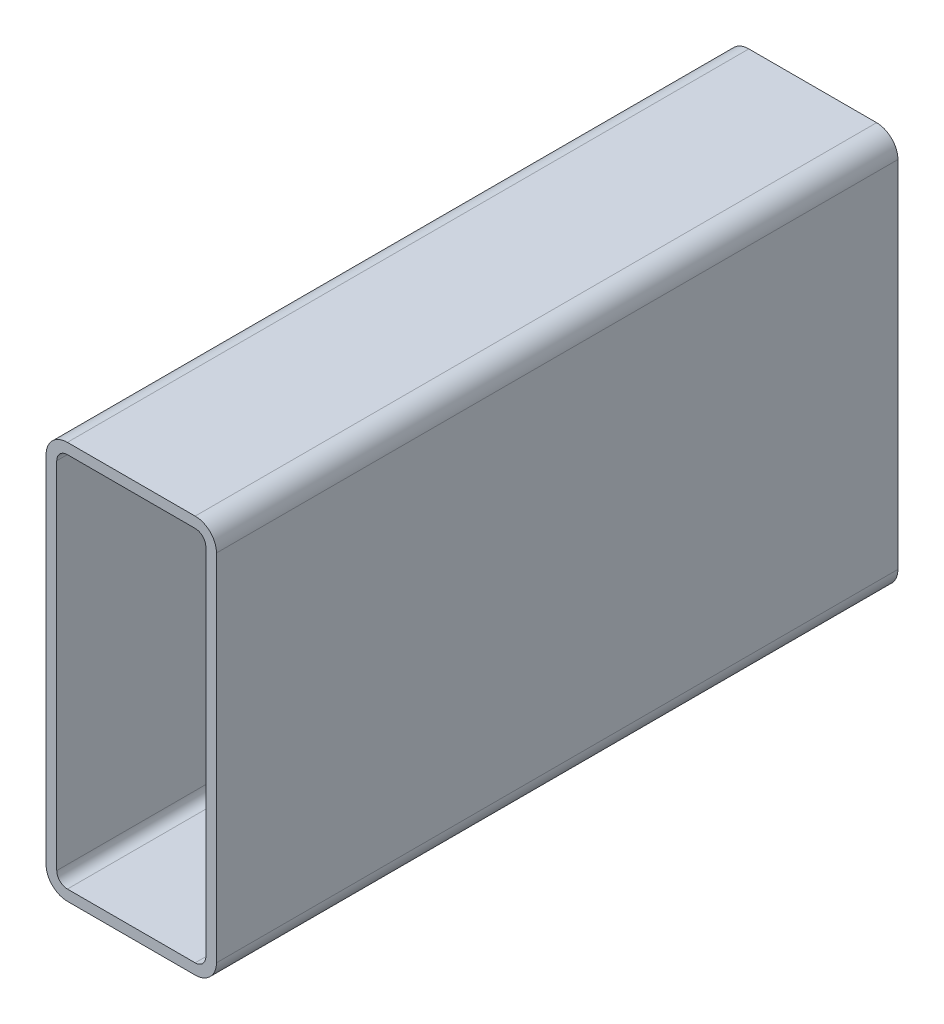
ISO-10303-21;
HEADER;
FILE_DESCRIPTION(('STEP AP214'),'2;1');
FILE_NAME('part.step','',(''),(''),'','','');
FILE_SCHEMA(('AUTOMOTIVE_DESIGN { 1 0 10303 214 1 1 1 1 }'));
ENDSEC;
DATA;
#1=APPLICATION_CONTEXT('core data for automotive mechanical design processes');
#2=APPLICATION_PROTOCOL_DEFINITION('international standard','automotive_design',2000,#1);
#3=PRODUCT_CONTEXT('',#1,'mechanical');
#4=PRODUCT('Part','Part','',(#3));
#5=PRODUCT_RELATED_PRODUCT_CATEGORY('part','',(#4));
#6=PRODUCT_DEFINITION_FORMATION('','',#4);
#7=PRODUCT_DEFINITION_CONTEXT('part definition',#1,'design');
#8=PRODUCT_DEFINITION('design','',#6,#7);
#9=PRODUCT_DEFINITION_SHAPE('','',#8);
#10=(LENGTH_UNIT() NAMED_UNIT(*) SI_UNIT(.MILLI.,.METRE.));
#11=(NAMED_UNIT(*) PLANE_ANGLE_UNIT() SI_UNIT($,.RADIAN.));
#12=(NAMED_UNIT(*) SI_UNIT($,.STERADIAN.) SOLID_ANGLE_UNIT());
#13=UNCERTAINTY_MEASURE_WITH_UNIT(LENGTH_MEASURE(1.E-05),#10,'distance_accuracy_value','');
#14=(GEOMETRIC_REPRESENTATION_CONTEXT(3) GLOBAL_UNCERTAINTY_ASSIGNED_CONTEXT((#13)) GLOBAL_UNIT_ASSIGNED_CONTEXT((#10,
#11,#12)) REPRESENTATION_CONTEXT('',''));
#15=CARTESIAN_POINT('',(0.,0.,0.));
#16=DIRECTION('',(0.,0.,1.));
#17=DIRECTION('',(1.,0.,0.));
#18=AXIS2_PLACEMENT_3D('',#15,#16,#17);
#19=CARTESIAN_POINT('',(12.0141160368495,170.264039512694,304.8));
#20=DIRECTION('',(0.,0.,1.));
#21=DIRECTION('',(1.,0.,0.));
#22=AXIS2_PLACEMENT_3D('',#19,#20,#21);
#23=PLANE('',#22);
#24=CARTESIAN_POINT('',(12.0141160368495,170.264039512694,304.8));
#25=DIRECTION('',(0.,0.,1.));
#26=DIRECTION('',(1.,0.,0.));
#27=AXIS2_PLACEMENT_3D('',#24,#25,#26);
#28=CIRCLE('',#27,9.525);
#29=CARTESIAN_POINT('',(12.0141160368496,179.789039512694,304.8));
#30=VERTEX_POINT('',#29);
#31=CARTESIAN_POINT('',(2.48911603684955,170.264039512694,304.8));
#32=VERTEX_POINT('',#31);
#33=EDGE_CURVE('E211',#30,#32,#28,.T.);
#34=ORIENTED_EDGE('',*,*,#33,.T.);
#35=DIRECTION('',(0.,-1.,0.));
#36=VECTOR('',#35,1.);
#37=CARTESIAN_POINT('',(2.48911603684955,11.5140395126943,304.8));
#38=LINE('',#37,#36);
#39=CARTESIAN_POINT('',(2.48911603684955,11.5140395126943,304.8));
#40=VERTEX_POINT('',#39);
#41=EDGE_CURVE('E214',#32,#40,#38,.T.);
#42=ORIENTED_EDGE('',*,*,#41,.T.);
#43=CARTESIAN_POINT('',(12.0141160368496,11.5140395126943,304.8));
#44=DIRECTION('',(0.,0.,1.));
#45=DIRECTION('',(1.,0.,0.));
#46=AXIS2_PLACEMENT_3D('',#43,#44,#45);
#47=CIRCLE('',#46,9.525);
#48=CARTESIAN_POINT('',(12.0141160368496,1.98903951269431,304.8));
#49=VERTEX_POINT('',#48);
#50=EDGE_CURVE('E217',#40,#49,#47,.T.);
#51=ORIENTED_EDGE('',*,*,#50,.T.);
#52=DIRECTION('',(1.,0.,0.));
#53=VECTOR('',#52,1.);
#54=CARTESIAN_POINT('',(69.1641160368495,1.98903951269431,304.8));
#55=LINE('',#54,#53);
#56=CARTESIAN_POINT('',(69.1641160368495,1.98903951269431,304.8));
#57=VERTEX_POINT('',#56);
#58=EDGE_CURVE('E219',#49,#57,#55,.T.);
#59=ORIENTED_EDGE('',*,*,#58,.T.);
#60=CARTESIAN_POINT('',(69.1641160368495,11.5140395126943,304.8));
#61=DIRECTION('',(0.,0.,1.));
#62=DIRECTION('',(1.,0.,0.));
#63=AXIS2_PLACEMENT_3D('',#60,#61,#62);
#64=CIRCLE('',#63,9.525);
#65=CARTESIAN_POINT('',(78.6891160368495,11.5140395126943,304.8));
#66=VERTEX_POINT('',#65);
#67=EDGE_CURVE('E221',#57,#66,#64,.T.);
#68=ORIENTED_EDGE('',*,*,#67,.T.);
#69=DIRECTION('',(0.,1.,0.));
#70=VECTOR('',#69,1.);
#71=CARTESIAN_POINT('',(78.6891160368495,170.264039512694,304.8));
#72=LINE('',#71,#70);
#73=CARTESIAN_POINT('',(78.6891160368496,170.264039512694,304.8));
#74=VERTEX_POINT('',#73);
#75=EDGE_CURVE('E223',#66,#74,#72,.T.);
#76=ORIENTED_EDGE('',*,*,#75,.T.);
#77=CARTESIAN_POINT('',(69.1641160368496,170.264039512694,304.8));
#78=DIRECTION('',(0.,0.,1.));
#79=DIRECTION('',(1.,0.,0.));
#80=AXIS2_PLACEMENT_3D('',#77,#78,#79);
#81=CIRCLE('',#80,9.52499999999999);
#82=CARTESIAN_POINT('',(69.1641160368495,179.789039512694,304.8));
#83=VERTEX_POINT('',#82);
#84=EDGE_CURVE('E225',#74,#83,#81,.T.);
#85=ORIENTED_EDGE('',*,*,#84,.T.);
#86=DIRECTION('',(-1.,0.,0.));
#87=VECTOR('',#86,1.);
#88=CARTESIAN_POINT('',(12.0141160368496,179.789039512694,304.8));
#89=LINE('',#88,#87);
#90=EDGE_CURVE('E227',#83,#30,#89,.T.);
#91=ORIENTED_EDGE('',*,*,#90,.T.);
#92=EDGE_LOOP('',(#34,#42,#51,#59,#68,#76,#85,#91));
#93=FACE_BOUND('',#92,.T.);
#94=DIRECTION('',(0.,-1.,0.));
#95=VECTOR('',#94,1.);
#96=CARTESIAN_POINT('',(7.25161603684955,11.5140395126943,304.8));
#97=LINE('',#96,#95);
#98=CARTESIAN_POINT('',(7.25161603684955,170.264039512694,304.8));
#99=VERTEX_POINT('',#98);
#100=CARTESIAN_POINT('',(7.25161603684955,11.5140395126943,304.8));
#101=VERTEX_POINT('',#100);
#102=EDGE_CURVE('E154',#99,#101,#97,.T.);
#103=ORIENTED_EDGE('',*,*,#102,.F.);
#104=CARTESIAN_POINT('',(12.0141160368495,170.264039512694,304.8));
#105=DIRECTION('',(0.,0.,1.));
#106=DIRECTION('',(1.,0.,0.));
#107=AXIS2_PLACEMENT_3D('',#104,#105,#106);
#108=CIRCLE('',#107,4.7625);
#109=CARTESIAN_POINT('',(12.0141160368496,175.026539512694,304.8));
#110=VERTEX_POINT('',#109);
#111=EDGE_CURVE('E146',#110,#99,#108,.T.);
#112=ORIENTED_EDGE('',*,*,#111,.F.);
#113=DIRECTION('',(-1.,0.,0.));
#114=VECTOR('',#113,1.);
#115=CARTESIAN_POINT('',(12.0141160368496,175.026539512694,304.8));
#116=LINE('',#115,#114);
#117=CARTESIAN_POINT('',(69.1641160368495,175.026539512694,304.8));
#118=VERTEX_POINT('',#117);
#119=EDGE_CURVE('E179',#118,#110,#116,.T.);
#120=ORIENTED_EDGE('',*,*,#119,.F.);
#121=CARTESIAN_POINT('',(69.1641160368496,170.264039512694,304.8));
#122=DIRECTION('',(0.,0.,1.));
#123=DIRECTION('',(1.,0.,0.));
#124=AXIS2_PLACEMENT_3D('',#121,#122,#123);
#125=CIRCLE('',#124,4.7625);
#126=CARTESIAN_POINT('',(73.9266160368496,170.264039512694,304.8));
#127=VERTEX_POINT('',#126);
#128=EDGE_CURVE('E177',#127,#118,#125,.T.);
#129=ORIENTED_EDGE('',*,*,#128,.F.);
#130=DIRECTION('',(0.,1.,0.));
#131=VECTOR('',#130,1.);
#132=CARTESIAN_POINT('',(73.9266160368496,170.264039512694,304.8));
#133=LINE('',#132,#131);
#134=CARTESIAN_POINT('',(73.9266160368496,11.5140395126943,304.8));
#135=VERTEX_POINT('',#134);
#136=EDGE_CURVE('E175',#135,#127,#133,.T.);
#137=ORIENTED_EDGE('',*,*,#136,.F.);
#138=CARTESIAN_POINT('',(69.1641160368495,11.5140395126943,304.8));
#139=DIRECTION('',(0.,0.,1.));
#140=DIRECTION('',(1.,0.,0.));
#141=AXIS2_PLACEMENT_3D('',#138,#139,#140);
#142=CIRCLE('',#141,4.7625);
#143=CARTESIAN_POINT('',(69.1641160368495,6.75153951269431,304.8));
#144=VERTEX_POINT('',#143);
#145=EDGE_CURVE('E173',#144,#135,#142,.T.);
#146=ORIENTED_EDGE('',*,*,#145,.F.);
#147=DIRECTION('',(1.,0.,0.));
#148=VECTOR('',#147,1.);
#149=CARTESIAN_POINT('',(69.1641160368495,6.75153951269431,304.8));
#150=LINE('',#149,#148);
#151=CARTESIAN_POINT('',(12.0141160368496,6.75153951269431,304.8));
#152=VERTEX_POINT('',#151);
#153=EDGE_CURVE('E169',#152,#144,#150,.T.);
#154=ORIENTED_EDGE('',*,*,#153,.F.);
#155=CARTESIAN_POINT('',(12.0141160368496,11.5140395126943,304.8));
#156=DIRECTION('',(0.,0.,1.));
#157=DIRECTION('',(1.,0.,0.));
#158=AXIS2_PLACEMENT_3D('',#155,#156,#157);
#159=CIRCLE('',#158,4.7625);
#160=EDGE_CURVE('E167',#101,#152,#159,.T.);
#161=ORIENTED_EDGE('',*,*,#160,.F.);
#162=EDGE_LOOP('',(#103,#112,#120,#129,#137,#146,#154,#161));
#163=FACE_BOUND('',#162,.T.);
#164=ADVANCED_FACE('F33',(#93,#163),#23,.T.);
#165=CARTESIAN_POINT('',(12.0141160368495,170.264039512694,0.));
#166=DIRECTION('',(0.,0.,1.));
#167=DIRECTION('',(1.,0.,0.));
#168=AXIS2_PLACEMENT_3D('',#165,#166,#167);
#169=PLANE('',#168);
#170=CARTESIAN_POINT('',(12.0141160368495,170.264039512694,0.));
#171=DIRECTION('',(0.,0.,1.));
#172=DIRECTION('',(1.,0.,0.));
#173=AXIS2_PLACEMENT_3D('',#170,#171,#172);
#174=CIRCLE('',#173,9.525);
#175=CARTESIAN_POINT('',(12.0141160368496,179.789039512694,0.));
#176=VERTEX_POINT('',#175);
#177=CARTESIAN_POINT('',(2.48911603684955,170.264039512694,0.));
#178=VERTEX_POINT('',#177);
#179=EDGE_CURVE('E162',#176,#178,#174,.T.);
#180=ORIENTED_EDGE('',*,*,#179,.F.);
#181=DIRECTION('',(-1.,0.,0.));
#182=VECTOR('',#181,1.);
#183=CARTESIAN_POINT('',(12.0141160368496,179.789039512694,0.));
#184=LINE('',#183,#182);
#185=CARTESIAN_POINT('',(69.1641160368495,179.789039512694,0.));
#186=VERTEX_POINT('',#185);
#187=EDGE_CURVE('E215',#186,#176,#184,.T.);
#188=ORIENTED_EDGE('',*,*,#187,.F.);
#189=CARTESIAN_POINT('',(69.1641160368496,170.264039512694,0.));
#190=DIRECTION('',(0.,0.,1.));
#191=DIRECTION('',(1.,0.,0.));
#192=AXIS2_PLACEMENT_3D('',#189,#190,#191);
#193=CIRCLE('',#192,9.52499999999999);
#194=CARTESIAN_POINT('',(78.6891160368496,170.264039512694,0.));
#195=VERTEX_POINT('',#194);
#196=EDGE_CURVE('E242',#195,#186,#193,.T.);
#197=ORIENTED_EDGE('',*,*,#196,.F.);
#198=DIRECTION('',(0.,1.,0.));
#199=VECTOR('',#198,1.);
#200=CARTESIAN_POINT('',(78.6891160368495,170.264039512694,0.));
#201=LINE('',#200,#199);
#202=CARTESIAN_POINT('',(78.6891160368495,11.5140395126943,0.));
#203=VERTEX_POINT('',#202);
#204=EDGE_CURVE('E240',#203,#195,#201,.T.);
#205=ORIENTED_EDGE('',*,*,#204,.F.);
#206=CARTESIAN_POINT('',(69.1641160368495,11.5140395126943,0.));
#207=DIRECTION('',(0.,0.,1.));
#208=DIRECTION('',(1.,0.,0.));
#209=AXIS2_PLACEMENT_3D('',#206,#207,#208);
#210=CIRCLE('',#209,9.525);
#211=CARTESIAN_POINT('',(69.1641160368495,1.98903951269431,0.));
#212=VERTEX_POINT('',#211);
#213=EDGE_CURVE('E238',#212,#203,#210,.T.);
#214=ORIENTED_EDGE('',*,*,#213,.F.);
#215=DIRECTION('',(1.,0.,0.));
#216=VECTOR('',#215,1.);
#217=CARTESIAN_POINT('',(69.1641160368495,1.98903951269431,0.));
#218=LINE('',#217,#216);
#219=CARTESIAN_POINT('',(12.0141160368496,1.98903951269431,0.));
#220=VERTEX_POINT('',#219);
#221=EDGE_CURVE('E236',#220,#212,#218,.T.);
#222=ORIENTED_EDGE('',*,*,#221,.F.);
#223=CARTESIAN_POINT('',(12.0141160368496,11.5140395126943,0.));
#224=DIRECTION('',(0.,0.,1.));
#225=DIRECTION('',(1.,0.,0.));
#226=AXIS2_PLACEMENT_3D('',#223,#224,#225);
#227=CIRCLE('',#226,9.525);
#228=CARTESIAN_POINT('',(2.48911603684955,11.5140395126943,0.));
#229=VERTEX_POINT('',#228);
#230=EDGE_CURVE('E234',#229,#220,#227,.T.);
#231=ORIENTED_EDGE('',*,*,#230,.F.);
#232=DIRECTION('',(0.,-1.,0.));
#233=VECTOR('',#232,1.);
#234=CARTESIAN_POINT('',(2.48911603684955,11.5140395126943,0.));
#235=LINE('',#234,#233);
#236=EDGE_CURVE('E232',#178,#229,#235,.T.);
#237=ORIENTED_EDGE('',*,*,#236,.F.);
#238=EDGE_LOOP('',(#180,#188,#197,#205,#214,#222,#231,#237));
#239=FACE_BOUND('',#238,.T.);
#240=CARTESIAN_POINT('',(12.0141160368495,170.264039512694,0.));
#241=DIRECTION('',(0.,0.,1.));
#242=DIRECTION('',(1.,0.,0.));
#243=AXIS2_PLACEMENT_3D('',#240,#241,#242);
#244=CIRCLE('',#243,4.7625);
#245=CARTESIAN_POINT('',(12.0141160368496,175.026539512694,0.));
#246=VERTEX_POINT('',#245);
#247=CARTESIAN_POINT('',(7.25161603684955,170.264039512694,0.));
#248=VERTEX_POINT('',#247);
#249=EDGE_CURVE('E56',#246,#248,#244,.T.);
#250=ORIENTED_EDGE('',*,*,#249,.T.);
#251=DIRECTION('',(0.,-1.,0.));
#252=VECTOR('',#251,1.);
#253=CARTESIAN_POINT('',(7.25161603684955,11.5140395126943,0.));
#254=LINE('',#253,#252);
#255=CARTESIAN_POINT('',(7.25161603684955,11.5140395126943,0.));
#256=VERTEX_POINT('',#255);
#257=EDGE_CURVE('E161',#248,#256,#254,.T.);
#258=ORIENTED_EDGE('',*,*,#257,.T.);
#259=CARTESIAN_POINT('',(12.0141160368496,11.5140395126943,0.));
#260=DIRECTION('',(0.,0.,1.));
#261=DIRECTION('',(1.,0.,0.));
#262=AXIS2_PLACEMENT_3D('',#259,#260,#261);
#263=CIRCLE('',#262,4.7625);
#264=CARTESIAN_POINT('',(12.0141160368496,6.75153951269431,0.));
#265=VERTEX_POINT('',#264);
#266=EDGE_CURVE('E183',#256,#265,#263,.T.);
#267=ORIENTED_EDGE('',*,*,#266,.T.);
#268=DIRECTION('',(1.,0.,0.));
#269=VECTOR('',#268,1.);
#270=CARTESIAN_POINT('',(69.1641160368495,6.75153951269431,0.));
#271=LINE('',#270,#269);
#272=CARTESIAN_POINT('',(69.1641160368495,6.75153951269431,0.));
#273=VERTEX_POINT('',#272);
#274=EDGE_CURVE('E186',#265,#273,#271,.T.);
#275=ORIENTED_EDGE('',*,*,#274,.T.);
#276=CARTESIAN_POINT('',(69.1641160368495,11.5140395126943,0.));
#277=DIRECTION('',(0.,0.,1.));
#278=DIRECTION('',(1.,0.,0.));
#279=AXIS2_PLACEMENT_3D('',#276,#277,#278);
#280=CIRCLE('',#279,4.7625);
#281=CARTESIAN_POINT('',(73.9266160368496,11.5140395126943,0.));
#282=VERTEX_POINT('',#281);
#283=EDGE_CURVE('E189',#273,#282,#280,.T.);
#284=ORIENTED_EDGE('',*,*,#283,.T.);
#285=DIRECTION('',(0.,1.,0.));
#286=VECTOR('',#285,1.);
#287=CARTESIAN_POINT('',(73.9266160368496,170.264039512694,0.));
#288=LINE('',#287,#286);
#289=CARTESIAN_POINT('',(73.9266160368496,170.264039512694,0.));
#290=VERTEX_POINT('',#289);
#291=EDGE_CURVE('E192',#282,#290,#288,.T.);
#292=ORIENTED_EDGE('',*,*,#291,.T.);
#293=CARTESIAN_POINT('',(69.1641160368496,170.264039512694,0.));
#294=DIRECTION('',(0.,0.,1.));
#295=DIRECTION('',(1.,0.,0.));
#296=AXIS2_PLACEMENT_3D('',#293,#294,#295);
#297=CIRCLE('',#296,4.7625);
#298=CARTESIAN_POINT('',(69.1641160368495,175.026539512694,0.));
#299=VERTEX_POINT('',#298);
#300=EDGE_CURVE('E195',#290,#299,#297,.T.);
#301=ORIENTED_EDGE('',*,*,#300,.T.);
#302=DIRECTION('',(-1.,0.,0.));
#303=VECTOR('',#302,1.);
#304=CARTESIAN_POINT('',(12.0141160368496,175.026539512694,0.));
#305=LINE('',#304,#303);
#306=EDGE_CURVE('E155',#299,#246,#305,.T.);
#307=ORIENTED_EDGE('',*,*,#306,.T.);
#308=EDGE_LOOP('',(#250,#258,#267,#275,#284,#292,#301,#307));
#309=FACE_BOUND('',#308,.T.);
#310=ADVANCED_FACE('F272',(#239,#309),#169,.F.);
#311=CARTESIAN_POINT('',(12.0141160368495,170.264039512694,304.8));
#312=DIRECTION('',(0.,0.,-1.));
#313=DIRECTION('',(-1.,0.,0.));
#314=AXIS2_PLACEMENT_3D('',#311,#312,#313);
#315=CYLINDRICAL_SURFACE('',#314,9.525);
#316=ORIENTED_EDGE('',*,*,#179,.T.);
#317=DIRECTION('',(0.,0.,-1.));
#318=VECTOR('',#317,1.);
#319=CARTESIAN_POINT('',(2.48911603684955,170.264039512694,304.8));
#320=LINE('',#319,#318);
#321=EDGE_CURVE('E11',#32,#178,#320,.T.);
#322=ORIENTED_EDGE('',*,*,#321,.F.);
#323=ORIENTED_EDGE('',*,*,#33,.F.);
#324=DIRECTION('',(0.,0.,-1.));
#325=VECTOR('',#324,1.);
#326=CARTESIAN_POINT('',(12.0141160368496,179.789039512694,304.8));
#327=LINE('',#326,#325);
#328=EDGE_CURVE('E229',#30,#176,#327,.T.);
#329=ORIENTED_EDGE('',*,*,#328,.T.);
#330=EDGE_LOOP('',(#316,#322,#323,#329));
#331=FACE_BOUND('',#330,.T.);
#332=ADVANCED_FACE('F35',(#331),#315,.T.);
#333=CARTESIAN_POINT('',(2.48911603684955,11.5140395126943,304.8));
#334=DIRECTION('',(1.,0.,0.));
#335=DIRECTION('',(0.,0.,-1.));
#336=AXIS2_PLACEMENT_3D('',#333,#334,#335);
#337=PLANE('',#336);
#338=ORIENTED_EDGE('',*,*,#236,.T.);
#339=DIRECTION('',(0.,0.,-1.));
#340=VECTOR('',#339,1.);
#341=CARTESIAN_POINT('',(2.48911603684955,11.5140395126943,304.8));
#342=LINE('',#341,#340);
#343=EDGE_CURVE('E41',#40,#229,#342,.T.);
#344=ORIENTED_EDGE('',*,*,#343,.F.);
#345=ORIENTED_EDGE('',*,*,#41,.F.);
#346=ORIENTED_EDGE('',*,*,#321,.T.);
#347=EDGE_LOOP('',(#338,#344,#345,#346));
#348=FACE_BOUND('',#347,.T.);
#349=ADVANCED_FACE('F289',(#348),#337,.F.);
#350=CARTESIAN_POINT('',(12.0141160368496,11.5140395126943,304.8));
#351=DIRECTION('',(0.,0.,-1.));
#352=DIRECTION('',(-1.,0.,0.));
#353=AXIS2_PLACEMENT_3D('',#350,#351,#352);
#354=CYLINDRICAL_SURFACE('',#353,9.525);
#355=ORIENTED_EDGE('',*,*,#230,.T.);
#356=DIRECTION('',(0.,0.,-1.));
#357=VECTOR('',#356,1.);
#358=CARTESIAN_POINT('',(12.0141160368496,1.98903951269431,304.8));
#359=LINE('',#358,#357);
#360=EDGE_CURVE('E259',#49,#220,#359,.T.);
#361=ORIENTED_EDGE('',*,*,#360,.F.);
#362=ORIENTED_EDGE('',*,*,#50,.F.);
#363=ORIENTED_EDGE('',*,*,#343,.T.);
#364=EDGE_LOOP('',(#355,#361,#362,#363));
#365=FACE_BOUND('',#364,.T.);
#366=ADVANCED_FACE('F266',(#365),#354,.T.);
#367=CARTESIAN_POINT('',(69.1641160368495,1.98903951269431,304.8));
#368=DIRECTION('',(0.,1.,0.));
#369=DIRECTION('',(0.,0.,1.));
#370=AXIS2_PLACEMENT_3D('',#367,#368,#369);
#371=PLANE('',#370);
#372=ORIENTED_EDGE('',*,*,#221,.T.);
#373=DIRECTION('',(0.,0.,-1.));
#374=VECTOR('',#373,1.);
#375=CARTESIAN_POINT('',(69.1641160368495,1.98903951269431,304.8));
#376=LINE('',#375,#374);
#377=EDGE_CURVE('E256',#57,#212,#376,.T.);
#378=ORIENTED_EDGE('',*,*,#377,.F.);
#379=ORIENTED_EDGE('',*,*,#58,.F.);
#380=ORIENTED_EDGE('',*,*,#360,.T.);
#381=EDGE_LOOP('',(#372,#378,#379,#380));
#382=FACE_BOUND('',#381,.T.);
#383=ADVANCED_FACE('F278',(#382),#371,.F.);
#384=CARTESIAN_POINT('',(69.1641160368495,11.5140395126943,304.8));
#385=DIRECTION('',(0.,0.,-1.));
#386=DIRECTION('',(-1.,0.,0.));
#387=AXIS2_PLACEMENT_3D('',#384,#385,#386);
#388=CYLINDRICAL_SURFACE('',#387,9.525);
#389=ORIENTED_EDGE('',*,*,#213,.T.);
#390=DIRECTION('',(0.,0.,-1.));
#391=VECTOR('',#390,1.);
#392=CARTESIAN_POINT('',(78.6891160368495,11.5140395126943,304.8));
#393=LINE('',#392,#391);
#394=EDGE_CURVE('E253',#66,#203,#393,.T.);
#395=ORIENTED_EDGE('',*,*,#394,.F.);
#396=ORIENTED_EDGE('',*,*,#67,.F.);
#397=ORIENTED_EDGE('',*,*,#377,.T.);
#398=EDGE_LOOP('',(#389,#395,#396,#397));
#399=FACE_BOUND('',#398,.T.);
#400=ADVANCED_FACE('F282',(#399),#388,.T.);
#401=CARTESIAN_POINT('',(78.6891160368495,170.264039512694,304.8));
#402=DIRECTION('',(-1.,0.,0.));
#403=DIRECTION('',(0.,0.,1.));
#404=AXIS2_PLACEMENT_3D('',#401,#402,#403);
#405=PLANE('',#404);
#406=ORIENTED_EDGE('',*,*,#204,.T.);
#407=DIRECTION('',(0.,0.,-1.));
#408=VECTOR('',#407,1.);
#409=CARTESIAN_POINT('',(78.6891160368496,170.264039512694,304.8));
#410=LINE('',#409,#408);
#411=EDGE_CURVE('E250',#74,#195,#410,.T.);
#412=ORIENTED_EDGE('',*,*,#411,.F.);
#413=ORIENTED_EDGE('',*,*,#75,.F.);
#414=ORIENTED_EDGE('',*,*,#394,.T.);
#415=EDGE_LOOP('',(#406,#412,#413,#414));
#416=FACE_BOUND('',#415,.T.);
#417=ADVANCED_FACE('F302',(#416),#405,.F.);
#418=CARTESIAN_POINT('',(69.1641160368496,170.264039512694,304.8));
#419=DIRECTION('',(0.,0.,-1.));
#420=DIRECTION('',(-1.,0.,0.));
#421=AXIS2_PLACEMENT_3D('',#418,#419,#420);
#422=CYLINDRICAL_SURFACE('',#421,9.52499999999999);
#423=ORIENTED_EDGE('',*,*,#196,.T.);
#424=DIRECTION('',(0.,0.,-1.));
#425=VECTOR('',#424,1.);
#426=CARTESIAN_POINT('',(69.1641160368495,179.789039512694,304.8));
#427=LINE('',#426,#425);
#428=EDGE_CURVE('E247',#83,#186,#427,.T.);
#429=ORIENTED_EDGE('',*,*,#428,.F.);
#430=ORIENTED_EDGE('',*,*,#84,.F.);
#431=ORIENTED_EDGE('',*,*,#411,.T.);
#432=EDGE_LOOP('',(#423,#429,#430,#431));
#433=FACE_BOUND('',#432,.T.);
#434=ADVANCED_FACE('F300',(#433),#422,.T.);
#435=CARTESIAN_POINT('',(12.0141160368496,179.789039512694,304.8));
#436=DIRECTION('',(0.,-1.,0.));
#437=DIRECTION('',(0.,0.,-1.));
#438=AXIS2_PLACEMENT_3D('',#435,#436,#437);
#439=PLANE('',#438);
#440=ORIENTED_EDGE('',*,*,#187,.T.);
#441=ORIENTED_EDGE('',*,*,#328,.F.);
#442=ORIENTED_EDGE('',*,*,#90,.F.);
#443=ORIENTED_EDGE('',*,*,#428,.T.);
#444=EDGE_LOOP('',(#440,#441,#442,#443));
#445=FACE_BOUND('',#444,.T.);
#446=ADVANCED_FACE('F295',(#445),#439,.F.);
#447=CARTESIAN_POINT('',(12.0141160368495,170.264039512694,304.8));
#448=DIRECTION('',(0.,0.,-1.));
#449=DIRECTION('',(-1.,0.,0.));
#450=AXIS2_PLACEMENT_3D('',#447,#448,#449);
#451=CYLINDRICAL_SURFACE('',#450,4.7625);
#452=ORIENTED_EDGE('',*,*,#249,.F.);
#453=DIRECTION('',(0.,0.,-1.));
#454=VECTOR('',#453,1.);
#455=CARTESIAN_POINT('',(12.0141160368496,175.026539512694,304.8));
#456=LINE('',#455,#454);
#457=EDGE_CURVE('E150',#110,#246,#456,.T.);
#458=ORIENTED_EDGE('',*,*,#457,.F.);
#459=ORIENTED_EDGE('',*,*,#111,.T.);
#460=DIRECTION('',(0.,0.,-1.));
#461=VECTOR('',#460,1.);
#462=CARTESIAN_POINT('',(7.25161603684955,170.264039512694,304.8));
#463=LINE('',#462,#461);
#464=EDGE_CURVE('E149',#99,#248,#463,.T.);
#465=ORIENTED_EDGE('',*,*,#464,.T.);
#466=EDGE_LOOP('',(#452,#458,#459,#465));
#467=FACE_BOUND('',#466,.T.);
#468=ADVANCED_FACE('F148',(#467),#451,.F.);
#469=CARTESIAN_POINT('',(7.25161603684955,11.5140395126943,304.8));
#470=DIRECTION('',(1.,0.,0.));
#471=DIRECTION('',(0.,0.,-1.));
#472=AXIS2_PLACEMENT_3D('',#469,#470,#471);
#473=PLANE('',#472);
#474=ORIENTED_EDGE('',*,*,#257,.F.);
#475=ORIENTED_EDGE('',*,*,#464,.F.);
#476=ORIENTED_EDGE('',*,*,#102,.T.);
#477=DIRECTION('',(0.,0.,-1.));
#478=VECTOR('',#477,1.);
#479=CARTESIAN_POINT('',(7.25161603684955,11.5140395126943,304.8));
#480=LINE('',#479,#478);
#481=EDGE_CURVE('E163',#101,#256,#480,.T.);
#482=ORIENTED_EDGE('',*,*,#481,.T.);
#483=EDGE_LOOP('',(#474,#475,#476,#482));
#484=FACE_BOUND('',#483,.T.);
#485=ADVANCED_FACE('F158',(#484),#473,.T.);
#486=CARTESIAN_POINT('',(12.0141160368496,11.5140395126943,304.8));
#487=DIRECTION('',(0.,0.,-1.));
#488=DIRECTION('',(-1.,0.,0.));
#489=AXIS2_PLACEMENT_3D('',#486,#487,#488);
#490=CYLINDRICAL_SURFACE('',#489,4.7625);
#491=ORIENTED_EDGE('',*,*,#266,.F.);
#492=ORIENTED_EDGE('',*,*,#481,.F.);
#493=ORIENTED_EDGE('',*,*,#160,.T.);
#494=DIRECTION('',(0.,0.,-1.));
#495=VECTOR('',#494,1.);
#496=CARTESIAN_POINT('',(12.0141160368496,6.75153951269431,304.8));
#497=LINE('',#496,#495);
#498=EDGE_CURVE('E208',#152,#265,#497,.T.);
#499=ORIENTED_EDGE('',*,*,#498,.T.);
#500=EDGE_LOOP('',(#491,#492,#493,#499));
#501=FACE_BOUND('',#500,.T.);
#502=ADVANCED_FACE('F327',(#501),#490,.F.);
#503=CARTESIAN_POINT('',(69.1641160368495,6.75153951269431,304.8));
#504=DIRECTION('',(0.,1.,0.));
#505=DIRECTION('',(0.,0.,1.));
#506=AXIS2_PLACEMENT_3D('',#503,#504,#505);
#507=PLANE('',#506);
#508=ORIENTED_EDGE('',*,*,#274,.F.);
#509=ORIENTED_EDGE('',*,*,#498,.F.);
#510=ORIENTED_EDGE('',*,*,#153,.T.);
#511=DIRECTION('',(0.,0.,-1.));
#512=VECTOR('',#511,1.);
#513=CARTESIAN_POINT('',(69.1641160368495,6.75153951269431,304.8));
#514=LINE('',#513,#512);
#515=EDGE_CURVE('E206',#144,#273,#514,.T.);
#516=ORIENTED_EDGE('',*,*,#515,.T.);
#517=EDGE_LOOP('',(#508,#509,#510,#516));
#518=FACE_BOUND('',#517,.T.);
#519=ADVANCED_FACE('F331',(#518),#507,.T.);
#520=CARTESIAN_POINT('',(69.1641160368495,11.5140395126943,304.8));
#521=DIRECTION('',(0.,0.,-1.));
#522=DIRECTION('',(-1.,0.,0.));
#523=AXIS2_PLACEMENT_3D('',#520,#521,#522);
#524=CYLINDRICAL_SURFACE('',#523,4.7625);
#525=ORIENTED_EDGE('',*,*,#283,.F.);
#526=ORIENTED_EDGE('',*,*,#515,.F.);
#527=ORIENTED_EDGE('',*,*,#145,.T.);
#528=DIRECTION('',(0.,0.,-1.));
#529=VECTOR('',#528,1.);
#530=CARTESIAN_POINT('',(73.9266160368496,11.5140395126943,304.8));
#531=LINE('',#530,#529);
#532=EDGE_CURVE('E204',#135,#282,#531,.T.);
#533=ORIENTED_EDGE('',*,*,#532,.T.);
#534=EDGE_LOOP('',(#525,#526,#527,#533));
#535=FACE_BOUND('',#534,.T.);
#536=ADVANCED_FACE('F337',(#535),#524,.F.);
#537=CARTESIAN_POINT('',(73.9266160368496,170.264039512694,304.8));
#538=DIRECTION('',(-1.,0.,0.));
#539=DIRECTION('',(0.,0.,1.));
#540=AXIS2_PLACEMENT_3D('',#537,#538,#539);
#541=PLANE('',#540);
#542=ORIENTED_EDGE('',*,*,#291,.F.);
#543=ORIENTED_EDGE('',*,*,#532,.F.);
#544=ORIENTED_EDGE('',*,*,#136,.T.);
#545=DIRECTION('',(0.,0.,-1.));
#546=VECTOR('',#545,1.);
#547=CARTESIAN_POINT('',(73.9266160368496,170.264039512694,304.8));
#548=LINE('',#547,#546);
#549=EDGE_CURVE('E202',#127,#290,#548,.T.);
#550=ORIENTED_EDGE('',*,*,#549,.T.);
#551=EDGE_LOOP('',(#542,#543,#544,#550));
#552=FACE_BOUND('',#551,.T.);
#553=ADVANCED_FACE('F341',(#552),#541,.T.);
#554=CARTESIAN_POINT('',(69.1641160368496,170.264039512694,304.8));
#555=DIRECTION('',(0.,0.,-1.));
#556=DIRECTION('',(-1.,0.,0.));
#557=AXIS2_PLACEMENT_3D('',#554,#555,#556);
#558=CYLINDRICAL_SURFACE('',#557,4.7625);
#559=ORIENTED_EDGE('',*,*,#300,.F.);
#560=ORIENTED_EDGE('',*,*,#549,.F.);
#561=ORIENTED_EDGE('',*,*,#128,.T.);
#562=DIRECTION('',(0.,0.,-1.));
#563=VECTOR('',#562,1.);
#564=CARTESIAN_POINT('',(69.1641160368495,175.026539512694,304.8));
#565=LINE('',#564,#563);
#566=EDGE_CURVE('E48',#118,#299,#565,.T.);
#567=ORIENTED_EDGE('',*,*,#566,.T.);
#568=EDGE_LOOP('',(#559,#560,#561,#567));
#569=FACE_BOUND('',#568,.T.);
#570=ADVANCED_FACE('F345',(#569),#558,.F.);
#571=CARTESIAN_POINT('',(12.0141160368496,175.026539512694,304.8));
#572=DIRECTION('',(0.,-1.,0.));
#573=DIRECTION('',(0.,0.,-1.));
#574=AXIS2_PLACEMENT_3D('',#571,#572,#573);
#575=PLANE('',#574);
#576=ORIENTED_EDGE('',*,*,#306,.F.);
#577=ORIENTED_EDGE('',*,*,#566,.F.);
#578=ORIENTED_EDGE('',*,*,#119,.T.);
#579=ORIENTED_EDGE('',*,*,#457,.T.);
#580=EDGE_LOOP('',(#576,#577,#578,#579));
#581=FACE_BOUND('',#580,.T.);
#582=ADVANCED_FACE('F349',(#581),#575,.T.);
#583=CLOSED_SHELL('',(#164,#310,#332,#349,#366,#383,#400,#417,#434,#446,#468,#485,#502,#519,
#536,#553,#570,#582));
#584=MANIFOLD_SOLID_BREP('B2',#583);
#585=ADVANCED_BREP_SHAPE_REPRESENTATION('',(#18,#584),#14);
#586=SHAPE_DEFINITION_REPRESENTATION(#9,#585);
ENDSEC;
END-ISO-10303-21;
